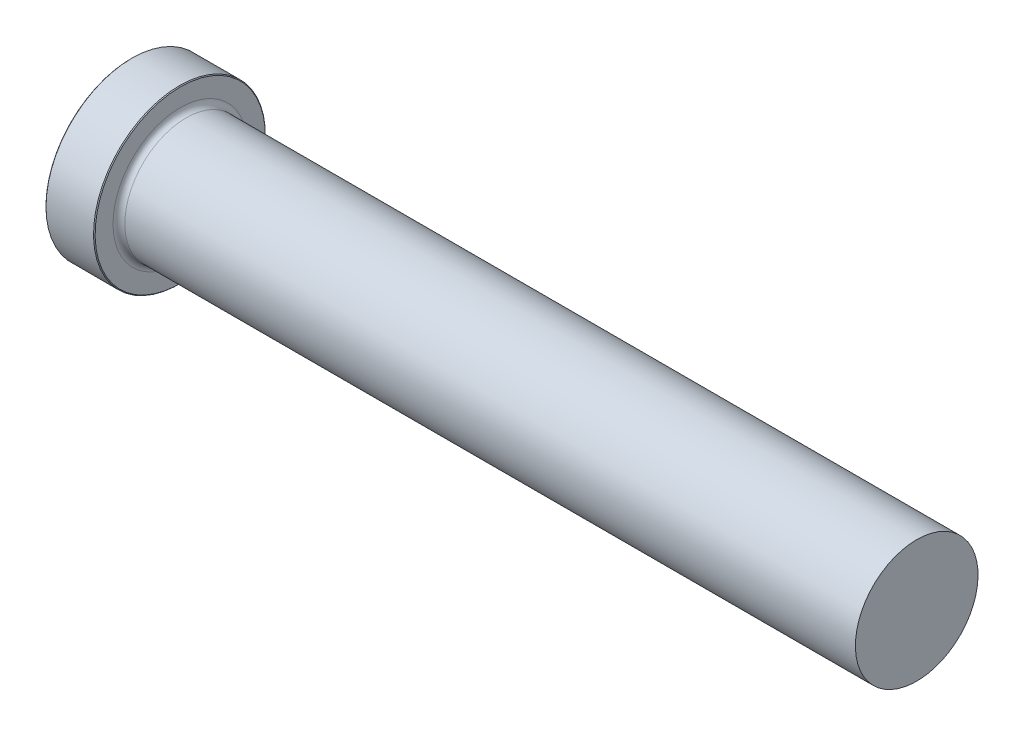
from build123d import *

# Parameters (mm, degrees)
CHAMFER1_SIZE = 0.1016


with BuildPart() as part:
    # Sketch1 → Revolve1 (revolve)
    with BuildSketch(Plane.XY):
        with BuildLine():
            Line((0, 0), (0, 11.1125))
            Line((0, 11.1125), (6.35, 11.1125))
            Line((6.35, 11.1125), (6.35, 8.69315))
            ThreePointArc((6.35, 8.69315), (6.573184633, 8.154334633), (7.112, 7.93115))
            Line((7.112, 7.93115), (101.6, 7.93115))
            Line((101.6, 7.93115), (101.6, 0))
            Line((101.6, 0), (0, 0))
        make_face()
    revolve(axis=Axis((101.6, 0, 0), (-1, 0, 0)))

    # Chamfer1
    chamfer1_edges = [part.edges().sort_by_distance(p)[0] for p in [
        (0, -11.1125, 0),
        (6.35, -11.1125, 0),
    ]]
    chamfer(chamfer1_edges, length=CHAMFER1_SIZE)


solid = part.part
